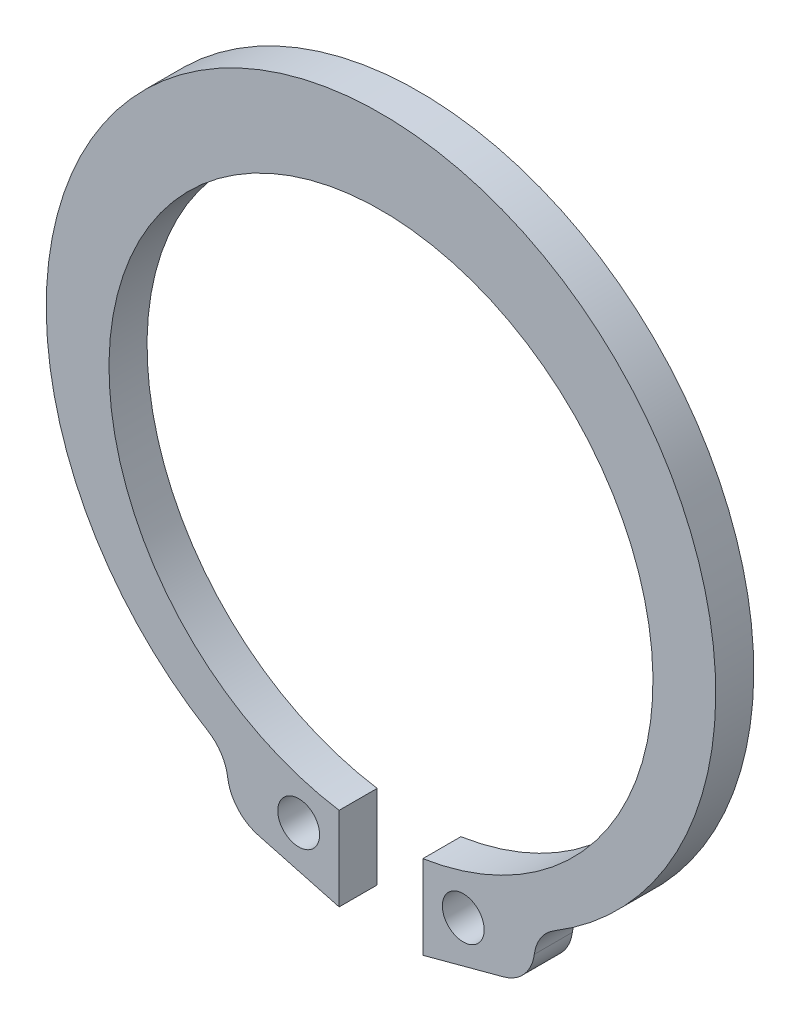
ISO-10303-21;
HEADER;
FILE_DESCRIPTION(('STEP AP214'),'2;1');
FILE_NAME('part.step','',(''),(''),'','','');
FILE_SCHEMA(('AUTOMOTIVE_DESIGN { 1 0 10303 214 1 1 1 1 }'));
ENDSEC;
DATA;
#1=APPLICATION_CONTEXT('core data for automotive mechanical design processes');
#2=APPLICATION_PROTOCOL_DEFINITION('international standard','automotive_design',2000,#1);
#3=PRODUCT_CONTEXT('',#1,'mechanical');
#4=PRODUCT('Part','Part','',(#3));
#5=PRODUCT_RELATED_PRODUCT_CATEGORY('part','',(#4));
#6=PRODUCT_DEFINITION_FORMATION('','',#4);
#7=PRODUCT_DEFINITION_CONTEXT('part definition',#1,'design');
#8=PRODUCT_DEFINITION('design','',#6,#7);
#9=PRODUCT_DEFINITION_SHAPE('','',#8);
#10=(LENGTH_UNIT() NAMED_UNIT(*) SI_UNIT(.MILLI.,.METRE.));
#11=(NAMED_UNIT(*) PLANE_ANGLE_UNIT() SI_UNIT($,.RADIAN.));
#12=(NAMED_UNIT(*) SI_UNIT($,.STERADIAN.) SOLID_ANGLE_UNIT());
#13=UNCERTAINTY_MEASURE_WITH_UNIT(LENGTH_MEASURE(1.E-05),#10,'distance_accuracy_value','');
#14=(GEOMETRIC_REPRESENTATION_CONTEXT(3) GLOBAL_UNCERTAINTY_ASSIGNED_CONTEXT((#13)) GLOBAL_UNIT_ASSIGNED_CONTEXT((#10,
#11,#12)) REPRESENTATION_CONTEXT('',''));
#15=CARTESIAN_POINT('',(0.,0.,0.));
#16=DIRECTION('',(0.,0.,1.));
#17=DIRECTION('',(1.,0.,0.));
#18=AXIS2_PLACEMENT_3D('',#15,#16,#17);
#19=CARTESIAN_POINT('',(-2.94033586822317,-7.63295761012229,0.5));
#20=DIRECTION('',(0.,0.,1.));
#21=DIRECTION('',(1.,0.,0.));
#22=AXIS2_PLACEMENT_3D('',#19,#20,#21);
#23=PLANE('',#22);
#24=CARTESIAN_POINT('',(2.16251840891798,-7.88017696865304,0.5));
#25=DIRECTION('',(0.,0.,1.));
#26=DIRECTION('',(-1.,0.,0.));
#27=AXIS2_PLACEMENT_3D('',#24,#25,#26);
#28=CIRCLE('',#27,0.55);
#29=CARTESIAN_POINT('',(1.61251840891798,-7.88017696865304,0.5));
#30=VERTEX_POINT('',#29);
#31=EDGE_CURVE('E149',#30,#30,#28,.T.);
#32=ORIENTED_EDGE('',*,*,#31,.F.);
#33=EDGE_LOOP('',(#32));
#34=FACE_BOUND('',#33,.T.);
#35=CARTESIAN_POINT('',(-2.94033586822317,-7.63295761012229,0.5));
#36=DIRECTION('',(0.,0.,1.));
#37=DIRECTION('',(1.,0.,0.));
#38=AXIS2_PLACEMENT_3D('',#35,#36,#37);
#39=CIRCLE('',#38,1.1);
#40=CARTESIAN_POINT('',(-4.03076730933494,-7.77773078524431,0.5));
#41=VERTEX_POINT('',#40);
#42=CARTESIAN_POINT('',(-3.22503681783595,-8.69547601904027,0.5));
#43=VERTEX_POINT('',#42);
#44=EDGE_CURVE('E164',#41,#43,#39,.T.);
#45=ORIENTED_EDGE('',*,*,#44,.T.);
#46=DIRECTION('',(0.965925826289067,-0.258819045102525,0.));
#47=VECTOR('',#46,1.);
#48=CARTESIAN_POINT('',(-1.1,-9.26487791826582,0.5));
#49=LINE('',#48,#47);
#50=CARTESIAN_POINT('',(-1.1,-9.26487791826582,0.5));
#51=VERTEX_POINT('',#50);
#52=EDGE_CURVE('E102',#43,#51,#49,.T.);
#53=ORIENTED_EDGE('',*,*,#52,.T.);
#54=DIRECTION('',(0.,1.,0.));
#55=VECTOR('',#54,1.);
#56=CARTESIAN_POINT('',(-1.1,-7.06487791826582,0.5));
#57=LINE('',#56,#55);
#58=CARTESIAN_POINT('',(-1.1,-7.06487791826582,0.5));
#59=VERTEX_POINT('',#58);
#60=EDGE_CURVE('E185',#51,#59,#57,.T.);
#61=ORIENTED_EDGE('',*,*,#60,.T.);
#62=CARTESIAN_POINT('',(0.,0.,0.5));
#63=DIRECTION('',(0.,0.,-1.));
#64=DIRECTION('',(1.,0.,0.));
#65=AXIS2_PLACEMENT_3D('',#62,#63,#64);
#66=CIRCLE('',#65,7.15);
#67=CARTESIAN_POINT('',(1.1,-7.06487791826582,0.5));
#68=VERTEX_POINT('',#67);
#69=EDGE_CURVE('E204',#59,#68,#66,.T.);
#70=ORIENTED_EDGE('',*,*,#69,.T.);
#71=DIRECTION('',(0.,-1.,0.));
#72=VECTOR('',#71,1.);
#73=CARTESIAN_POINT('',(1.1,-7.06487791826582,0.5));
#74=LINE('',#73,#72);
#75=CARTESIAN_POINT('',(1.1,-9.26487791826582,0.5));
#76=VERTEX_POINT('',#75);
#77=EDGE_CURVE('E201',#68,#76,#74,.T.);
#78=ORIENTED_EDGE('',*,*,#77,.T.);
#79=DIRECTION('',(0.965925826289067,0.258819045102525,0.));
#80=VECTOR('',#79,1.);
#81=CARTESIAN_POINT('',(1.1,-9.26487791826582,0.5));
#82=LINE('',#81,#80);
#83=CARTESIAN_POINT('',(3.22503681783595,-8.69547601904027,0.5));
#84=VERTEX_POINT('',#83);
#85=EDGE_CURVE('E203',#76,#84,#82,.T.);
#86=ORIENTED_EDGE('',*,*,#85,.T.);
#87=CARTESIAN_POINT('',(2.94033586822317,-7.63295761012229,0.5));
#88=DIRECTION('',(0.,0.,1.));
#89=DIRECTION('',(-1.,0.,0.));
#90=AXIS2_PLACEMENT_3D('',#87,#88,#89);
#91=CIRCLE('',#90,1.1);
#92=CARTESIAN_POINT('',(4.03076730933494,-7.77773078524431,0.5));
#93=VERTEX_POINT('',#92);
#94=EDGE_CURVE('E127',#84,#93,#91,.T.);
#95=ORIENTED_EDGE('',*,*,#94,.T.);
#96=CARTESIAN_POINT('',(5.12119875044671,-7.92250396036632,0.5));
#97=DIRECTION('',(0.,0.,-1.));
#98=DIRECTION('',(-1.,0.,0.));
#99=AXIS2_PLACEMENT_3D('',#96,#97,#98);
#100=CIRCLE('',#99,1.1);
#101=CARTESIAN_POINT('',(4.55217666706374,-6.98111463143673,0.5));
#102=VERTEX_POINT('',#101);
#103=EDGE_CURVE('E121',#93,#102,#100,.T.);
#104=ORIENTED_EDGE('',*,*,#103,.T.);
#105=CARTESIAN_POINT('',(0.,0.55,0.5));
#106=DIRECTION('',(0.,0.,1.));
#107=DIRECTION('',(1.,0.,0.));
#108=AXIS2_PLACEMENT_3D('',#105,#106,#107);
#109=CIRCLE('',#108,8.8);
#110=CARTESIAN_POINT('',(-4.55217666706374,-6.98111463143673,0.5));
#111=VERTEX_POINT('',#110);
#112=EDGE_CURVE('E125',#102,#111,#109,.T.);
#113=ORIENTED_EDGE('',*,*,#112,.T.);
#114=CARTESIAN_POINT('',(-5.12119875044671,-7.92250396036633,0.5));
#115=DIRECTION('',(0.,0.,-1.));
#116=DIRECTION('',(1.,0.,0.));
#117=AXIS2_PLACEMENT_3D('',#114,#115,#116);
#118=CIRCLE('',#117,1.1);
#119=EDGE_CURVE('E53',#111,#41,#118,.T.);
#120=ORIENTED_EDGE('',*,*,#119,.T.);
#121=EDGE_LOOP('',(#45,#53,#61,#70,#78,#86,#95,#104,#113,#120));
#122=FACE_BOUND('',#121,.T.);
#123=CARTESIAN_POINT('',(-2.16251840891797,-7.88017696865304,0.5));
#124=DIRECTION('',(0.,0.,1.));
#125=DIRECTION('',(1.,0.,0.));
#126=AXIS2_PLACEMENT_3D('',#123,#124,#125);
#127=CIRCLE('',#126,0.55);
#128=CARTESIAN_POINT('',(-1.61251840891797,-7.88017696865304,0.5));
#129=VERTEX_POINT('',#128);
#130=EDGE_CURVE('E215',#129,#129,#127,.T.);
#131=ORIENTED_EDGE('',*,*,#130,.F.);
#132=EDGE_LOOP('',(#131));
#133=FACE_BOUND('',#132,.T.);
#134=ADVANCED_FACE('F36',(#34,#122,#133),#23,.T.);
#135=CARTESIAN_POINT('',(-2.94033586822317,-7.63295761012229,-0.5));
#136=DIRECTION('',(0.,0.,1.));
#137=DIRECTION('',(1.,0.,0.));
#138=AXIS2_PLACEMENT_3D('',#135,#136,#137);
#139=PLANE('',#138);
#140=CARTESIAN_POINT('',(2.16251840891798,-7.88017696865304,-0.5));
#141=DIRECTION('',(0.,0.,1.));
#142=DIRECTION('',(-1.,0.,0.));
#143=AXIS2_PLACEMENT_3D('',#140,#141,#142);
#144=CIRCLE('',#143,0.55);
#145=CARTESIAN_POINT('',(1.61251840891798,-7.88017696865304,-0.5));
#146=VERTEX_POINT('',#145);
#147=EDGE_CURVE('E212',#146,#146,#144,.T.);
#148=ORIENTED_EDGE('',*,*,#147,.T.);
#149=EDGE_LOOP('',(#148));
#150=FACE_BOUND('',#149,.T.);
#151=CARTESIAN_POINT('',(-2.94033586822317,-7.63295761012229,-0.5));
#152=DIRECTION('',(0.,0.,1.));
#153=DIRECTION('',(1.,0.,0.));
#154=AXIS2_PLACEMENT_3D('',#151,#152,#153);
#155=CIRCLE('',#154,1.1);
#156=CARTESIAN_POINT('',(-4.03076730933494,-7.77773078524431,-0.5));
#157=VERTEX_POINT('',#156);
#158=CARTESIAN_POINT('',(-3.22503681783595,-8.69547601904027,-0.5));
#159=VERTEX_POINT('',#158);
#160=EDGE_CURVE('E145',#157,#159,#155,.T.);
#161=ORIENTED_EDGE('',*,*,#160,.F.);
#162=CARTESIAN_POINT('',(-5.12119875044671,-7.92250396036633,-0.5));
#163=DIRECTION('',(0.,0.,-1.));
#164=DIRECTION('',(1.,0.,0.));
#165=AXIS2_PLACEMENT_3D('',#162,#163,#164);
#166=CIRCLE('',#165,1.1);
#167=CARTESIAN_POINT('',(-4.55217666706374,-6.98111463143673,-0.5));
#168=VERTEX_POINT('',#167);
#169=EDGE_CURVE('E94',#168,#157,#166,.T.);
#170=ORIENTED_EDGE('',*,*,#169,.F.);
#171=CARTESIAN_POINT('',(0.,0.55,-0.5));
#172=DIRECTION('',(0.,0.,1.));
#173=DIRECTION('',(1.,0.,0.));
#174=AXIS2_PLACEMENT_3D('',#171,#172,#173);
#175=CIRCLE('',#174,8.8);
#176=CARTESIAN_POINT('',(4.55217666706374,-6.98111463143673,-0.5));
#177=VERTEX_POINT('',#176);
#178=EDGE_CURVE('E88',#177,#168,#175,.T.);
#179=ORIENTED_EDGE('',*,*,#178,.F.);
#180=CARTESIAN_POINT('',(5.12119875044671,-7.92250396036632,-0.5));
#181=DIRECTION('',(0.,0.,-1.));
#182=DIRECTION('',(-1.,0.,0.));
#183=AXIS2_PLACEMENT_3D('',#180,#181,#182);
#184=CIRCLE('',#183,1.1);
#185=CARTESIAN_POINT('',(4.03076730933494,-7.77773078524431,-0.5));
#186=VERTEX_POINT('',#185);
#187=EDGE_CURVE('E135',#186,#177,#184,.T.);
#188=ORIENTED_EDGE('',*,*,#187,.F.);
#189=CARTESIAN_POINT('',(2.94033586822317,-7.63295761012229,-0.5));
#190=DIRECTION('',(0.,0.,1.));
#191=DIRECTION('',(-1.,0.,0.));
#192=AXIS2_PLACEMENT_3D('',#189,#190,#191);
#193=CIRCLE('',#192,1.1);
#194=CARTESIAN_POINT('',(3.22503681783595,-8.69547601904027,-0.5));
#195=VERTEX_POINT('',#194);
#196=EDGE_CURVE('E159',#195,#186,#193,.T.);
#197=ORIENTED_EDGE('',*,*,#196,.F.);
#198=DIRECTION('',(0.965925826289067,0.258819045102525,0.));
#199=VECTOR('',#198,1.);
#200=CARTESIAN_POINT('',(1.1,-9.26487791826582,-0.5));
#201=LINE('',#200,#199);
#202=CARTESIAN_POINT('',(1.1,-9.26487791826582,-0.5));
#203=VERTEX_POINT('',#202);
#204=EDGE_CURVE('E157',#203,#195,#201,.T.);
#205=ORIENTED_EDGE('',*,*,#204,.F.);
#206=DIRECTION('',(0.,-1.,0.));
#207=VECTOR('',#206,1.);
#208=CARTESIAN_POINT('',(1.1,-7.06487791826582,-0.5));
#209=LINE('',#208,#207);
#210=CARTESIAN_POINT('',(1.1,-7.06487791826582,-0.5));
#211=VERTEX_POINT('',#210);
#212=EDGE_CURVE('E155',#211,#203,#209,.T.);
#213=ORIENTED_EDGE('',*,*,#212,.F.);
#214=CARTESIAN_POINT('',(0.,0.,-0.5));
#215=DIRECTION('',(0.,0.,-1.));
#216=DIRECTION('',(1.,0.,0.));
#217=AXIS2_PLACEMENT_3D('',#214,#215,#216);
#218=CIRCLE('',#217,7.15);
#219=CARTESIAN_POINT('',(-1.1,-7.06487791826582,-0.5));
#220=VERTEX_POINT('',#219);
#221=EDGE_CURVE('E153',#220,#211,#218,.T.);
#222=ORIENTED_EDGE('',*,*,#221,.F.);
#223=DIRECTION('',(0.,1.,0.));
#224=VECTOR('',#223,1.);
#225=CARTESIAN_POINT('',(-1.1,-7.06487791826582,-0.5));
#226=LINE('',#225,#224);
#227=CARTESIAN_POINT('',(-1.1,-9.26487791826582,-0.5));
#228=VERTEX_POINT('',#227);
#229=EDGE_CURVE('E151',#228,#220,#226,.T.);
#230=ORIENTED_EDGE('',*,*,#229,.F.);
#231=DIRECTION('',(0.965925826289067,-0.258819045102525,0.));
#232=VECTOR('',#231,1.);
#233=CARTESIAN_POINT('',(-1.1,-9.26487791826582,-0.5));
#234=LINE('',#233,#232);
#235=EDGE_CURVE('E148',#159,#228,#234,.T.);
#236=ORIENTED_EDGE('',*,*,#235,.F.);
#237=EDGE_LOOP('',(#161,#170,#179,#188,#197,#205,#213,#222,#230,#236));
#238=FACE_BOUND('',#237,.T.);
#239=CARTESIAN_POINT('',(-2.16251840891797,-7.88017696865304,-0.5));
#240=DIRECTION('',(0.,0.,1.));
#241=DIRECTION('',(1.,0.,0.));
#242=AXIS2_PLACEMENT_3D('',#239,#240,#241);
#243=CIRCLE('',#242,0.55);
#244=CARTESIAN_POINT('',(-1.61251840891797,-7.88017696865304,-0.5));
#245=VERTEX_POINT('',#244);
#246=EDGE_CURVE('E218',#245,#245,#243,.T.);
#247=ORIENTED_EDGE('',*,*,#246,.T.);
#248=EDGE_LOOP('',(#247));
#249=FACE_BOUND('',#248,.T.);
#250=ADVANCED_FACE('F189',(#150,#238,#249),#139,.F.);
#251=CARTESIAN_POINT('',(-2.94033586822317,-7.63295761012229,0.5));
#252=DIRECTION('',(0.,0.,-1.));
#253=DIRECTION('',(-1.,0.,0.));
#254=AXIS2_PLACEMENT_3D('',#251,#252,#253);
#255=CYLINDRICAL_SURFACE('',#254,1.1);
#256=ORIENTED_EDGE('',*,*,#160,.T.);
#257=DIRECTION('',(0.,0.,-1.));
#258=VECTOR('',#257,1.);
#259=CARTESIAN_POINT('',(-3.22503681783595,-8.69547601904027,0.5));
#260=LINE('',#259,#258);
#261=EDGE_CURVE('E11',#43,#159,#260,.T.);
#262=ORIENTED_EDGE('',*,*,#261,.F.);
#263=ORIENTED_EDGE('',*,*,#44,.F.);
#264=DIRECTION('',(0.,0.,-1.));
#265=VECTOR('',#264,1.);
#266=CARTESIAN_POINT('',(-4.03076730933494,-7.77773078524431,0.5));
#267=LINE('',#266,#265);
#268=EDGE_CURVE('E141',#41,#157,#267,.T.);
#269=ORIENTED_EDGE('',*,*,#268,.T.);
#270=EDGE_LOOP('',(#256,#262,#263,#269));
#271=FACE_BOUND('',#270,.T.);
#272=ADVANCED_FACE('F38',(#271),#255,.T.);
#273=CARTESIAN_POINT('',(-1.1,-9.26487791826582,0.5));
#274=DIRECTION('',(0.258819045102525,0.965925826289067,0.));
#275=DIRECTION('',(-0.965925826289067,0.258819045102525,0.));
#276=AXIS2_PLACEMENT_3D('',#273,#274,#275);
#277=PLANE('',#276);
#278=ORIENTED_EDGE('',*,*,#235,.T.);
#279=DIRECTION('',(0.,0.,-1.));
#280=VECTOR('',#279,1.);
#281=CARTESIAN_POINT('',(-1.1,-9.26487791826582,0.5));
#282=LINE('',#281,#280);
#283=EDGE_CURVE('E45',#51,#228,#282,.T.);
#284=ORIENTED_EDGE('',*,*,#283,.F.);
#285=ORIENTED_EDGE('',*,*,#52,.F.);
#286=ORIENTED_EDGE('',*,*,#261,.T.);
#287=EDGE_LOOP('',(#278,#284,#285,#286));
#288=FACE_BOUND('',#287,.T.);
#289=ADVANCED_FACE('F259',(#288),#277,.F.);
#290=CARTESIAN_POINT('',(-1.1,-7.06487791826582,0.5));
#291=DIRECTION('',(-1.,0.,0.));
#292=DIRECTION('',(0.,-1.,0.));
#293=AXIS2_PLACEMENT_3D('',#290,#291,#292);
#294=PLANE('',#293);
#295=ORIENTED_EDGE('',*,*,#229,.T.);
#296=DIRECTION('',(0.,0.,-1.));
#297=VECTOR('',#296,1.);
#298=CARTESIAN_POINT('',(-1.1,-7.06487791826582,0.5));
#299=LINE('',#298,#297);
#300=EDGE_CURVE('E177',#59,#220,#299,.T.);
#301=ORIENTED_EDGE('',*,*,#300,.F.);
#302=ORIENTED_EDGE('',*,*,#60,.F.);
#303=ORIENTED_EDGE('',*,*,#283,.T.);
#304=EDGE_LOOP('',(#295,#301,#302,#303));
#305=FACE_BOUND('',#304,.T.);
#306=ADVANCED_FACE('F183',(#305),#294,.F.);
#307=CARTESIAN_POINT('',(0.,0.,0.5));
#308=DIRECTION('',(0.,0.,-1.));
#309=DIRECTION('',(-1.,0.,0.));
#310=AXIS2_PLACEMENT_3D('',#307,#308,#309);
#311=CYLINDRICAL_SURFACE('',#310,7.15);
#312=ORIENTED_EDGE('',*,*,#221,.T.);
#313=DIRECTION('',(0.,0.,-1.));
#314=VECTOR('',#313,1.);
#315=CARTESIAN_POINT('',(1.1,-7.06487791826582,0.5));
#316=LINE('',#315,#314);
#317=EDGE_CURVE('E174',#68,#211,#316,.T.);
#318=ORIENTED_EDGE('',*,*,#317,.F.);
#319=ORIENTED_EDGE('',*,*,#69,.F.);
#320=ORIENTED_EDGE('',*,*,#300,.T.);
#321=EDGE_LOOP('',(#312,#318,#319,#320));
#322=FACE_BOUND('',#321,.T.);
#323=ADVANCED_FACE('F195',(#322),#311,.F.);
#324=CARTESIAN_POINT('',(1.1,-7.06487791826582,0.5));
#325=DIRECTION('',(1.,0.,0.));
#326=DIRECTION('',(0.,1.,0.));
#327=AXIS2_PLACEMENT_3D('',#324,#325,#326);
#328=PLANE('',#327);
#329=ORIENTED_EDGE('',*,*,#212,.T.);
#330=DIRECTION('',(0.,0.,-1.));
#331=VECTOR('',#330,1.);
#332=CARTESIAN_POINT('',(1.1,-9.26487791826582,0.5));
#333=LINE('',#332,#331);
#334=EDGE_CURVE('E171',#76,#203,#333,.T.);
#335=ORIENTED_EDGE('',*,*,#334,.F.);
#336=ORIENTED_EDGE('',*,*,#77,.F.);
#337=ORIENTED_EDGE('',*,*,#317,.T.);
#338=EDGE_LOOP('',(#329,#335,#336,#337));
#339=FACE_BOUND('',#338,.T.);
#340=ADVANCED_FACE('F199',(#339),#328,.F.);
#341=CARTESIAN_POINT('',(1.1,-9.26487791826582,0.5));
#342=DIRECTION('',(-0.258819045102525,0.965925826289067,0.));
#343=DIRECTION('',(-0.965925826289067,-0.258819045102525,0.));
#344=AXIS2_PLACEMENT_3D('',#341,#342,#343);
#345=PLANE('',#344);
#346=ORIENTED_EDGE('',*,*,#204,.T.);
#347=DIRECTION('',(0.,0.,-1.));
#348=VECTOR('',#347,1.);
#349=CARTESIAN_POINT('',(3.22503681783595,-8.69547601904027,0.5));
#350=LINE('',#349,#348);
#351=EDGE_CURVE('E168',#84,#195,#350,.T.);
#352=ORIENTED_EDGE('',*,*,#351,.F.);
#353=ORIENTED_EDGE('',*,*,#85,.F.);
#354=ORIENTED_EDGE('',*,*,#334,.T.);
#355=EDGE_LOOP('',(#346,#352,#353,#354));
#356=FACE_BOUND('',#355,.T.);
#357=ADVANCED_FACE('F249',(#356),#345,.F.);
#358=CARTESIAN_POINT('',(2.94033586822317,-7.63295761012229,0.5));
#359=DIRECTION('',(0.,0.,-1.));
#360=DIRECTION('',(-1.,0.,0.));
#361=AXIS2_PLACEMENT_3D('',#358,#359,#360);
#362=CYLINDRICAL_SURFACE('',#361,1.1);
#363=ORIENTED_EDGE('',*,*,#196,.T.);
#364=DIRECTION('',(0.,0.,-1.));
#365=VECTOR('',#364,1.);
#366=CARTESIAN_POINT('',(4.03076730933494,-7.77773078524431,0.5));
#367=LINE('',#366,#365);
#368=EDGE_CURVE('E136',#93,#186,#367,.T.);
#369=ORIENTED_EDGE('',*,*,#368,.F.);
#370=ORIENTED_EDGE('',*,*,#94,.F.);
#371=ORIENTED_EDGE('',*,*,#351,.T.);
#372=EDGE_LOOP('',(#363,#369,#370,#371));
#373=FACE_BOUND('',#372,.T.);
#374=ADVANCED_FACE('F246',(#373),#362,.T.);
#375=CARTESIAN_POINT('',(5.12119875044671,-7.92250396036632,0.5));
#376=DIRECTION('',(0.,0.,-1.));
#377=DIRECTION('',(-1.,0.,0.));
#378=AXIS2_PLACEMENT_3D('',#375,#376,#377);
#379=CYLINDRICAL_SURFACE('',#378,1.1);
#380=ORIENTED_EDGE('',*,*,#187,.T.);
#381=DIRECTION('',(0.,0.,-1.));
#382=VECTOR('',#381,1.);
#383=CARTESIAN_POINT('',(4.55217666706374,-6.98111463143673,0.5));
#384=LINE('',#383,#382);
#385=EDGE_CURVE('E132',#102,#177,#384,.T.);
#386=ORIENTED_EDGE('',*,*,#385,.F.);
#387=ORIENTED_EDGE('',*,*,#103,.F.);
#388=ORIENTED_EDGE('',*,*,#368,.T.);
#389=EDGE_LOOP('',(#380,#386,#387,#388));
#390=FACE_BOUND('',#389,.T.);
#391=ADVANCED_FACE('F133',(#390),#379,.F.);
#392=CARTESIAN_POINT('',(0.,0.55,0.5));
#393=DIRECTION('',(0.,0.,-1.));
#394=DIRECTION('',(-1.,0.,0.));
#395=AXIS2_PLACEMENT_3D('',#392,#393,#394);
#396=CYLINDRICAL_SURFACE('',#395,8.8);
#397=ORIENTED_EDGE('',*,*,#178,.T.);
#398=DIRECTION('',(0.,0.,-1.));
#399=VECTOR('',#398,1.);
#400=CARTESIAN_POINT('',(-4.55217666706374,-6.98111463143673,0.5));
#401=LINE('',#400,#399);
#402=EDGE_CURVE('E137',#111,#168,#401,.T.);
#403=ORIENTED_EDGE('',*,*,#402,.F.);
#404=ORIENTED_EDGE('',*,*,#112,.F.);
#405=ORIENTED_EDGE('',*,*,#385,.T.);
#406=EDGE_LOOP('',(#397,#403,#404,#405));
#407=FACE_BOUND('',#406,.T.);
#408=ADVANCED_FACE('F139',(#407),#396,.T.);
#409=CARTESIAN_POINT('',(-5.12119875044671,-7.92250396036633,0.5));
#410=DIRECTION('',(0.,0.,-1.));
#411=DIRECTION('',(-1.,0.,0.));
#412=AXIS2_PLACEMENT_3D('',#409,#410,#411);
#413=CYLINDRICAL_SURFACE('',#412,1.1);
#414=ORIENTED_EDGE('',*,*,#169,.T.);
#415=ORIENTED_EDGE('',*,*,#268,.F.);
#416=ORIENTED_EDGE('',*,*,#119,.F.);
#417=ORIENTED_EDGE('',*,*,#402,.T.);
#418=EDGE_LOOP('',(#414,#415,#416,#417));
#419=FACE_BOUND('',#418,.T.);
#420=ADVANCED_FACE('F239',(#419),#413,.F.);
#421=CARTESIAN_POINT('',(2.16251840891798,-7.88017696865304,0.5));
#422=DIRECTION('',(0.,0.,-1.));
#423=DIRECTION('',(-1.,0.,0.));
#424=AXIS2_PLACEMENT_3D('',#421,#422,#423);
#425=CYLINDRICAL_SURFACE('',#424,0.55);
#426=ORIENTED_EDGE('',*,*,#31,.T.);
#427=EDGE_LOOP('',(#426));
#428=FACE_BOUND('',#427,.T.);
#429=ORIENTED_EDGE('',*,*,#147,.F.);
#430=EDGE_LOOP('',(#429));
#431=FACE_BOUND('',#430,.T.);
#432=ADVANCED_FACE('F236',(#428,#431),#425,.F.);
#433=CARTESIAN_POINT('',(-2.16251840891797,-7.88017696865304,0.5));
#434=DIRECTION('',(0.,0.,-1.));
#435=DIRECTION('',(-1.,0.,0.));
#436=AXIS2_PLACEMENT_3D('',#433,#434,#435);
#437=CYLINDRICAL_SURFACE('',#436,0.55);
#438=ORIENTED_EDGE('',*,*,#130,.T.);
#439=EDGE_LOOP('',(#438));
#440=FACE_BOUND('',#439,.T.);
#441=ORIENTED_EDGE('',*,*,#246,.F.);
#442=EDGE_LOOP('',(#441));
#443=FACE_BOUND('',#442,.T.);
#444=ADVANCED_FACE('F224',(#440,#443),#437,.F.);
#445=CLOSED_SHELL('',(#134,#250,#272,#289,#306,#323,#340,#357,#374,#391,#408,#420,#432,#444));
#446=MANIFOLD_SOLID_BREP('B2',#445);
#447=ADVANCED_BREP_SHAPE_REPRESENTATION('',(#18,#446),#14);
#448=SHAPE_DEFINITION_REPRESENTATION(#9,#447);
ENDSEC;
END-ISO-10303-21;
